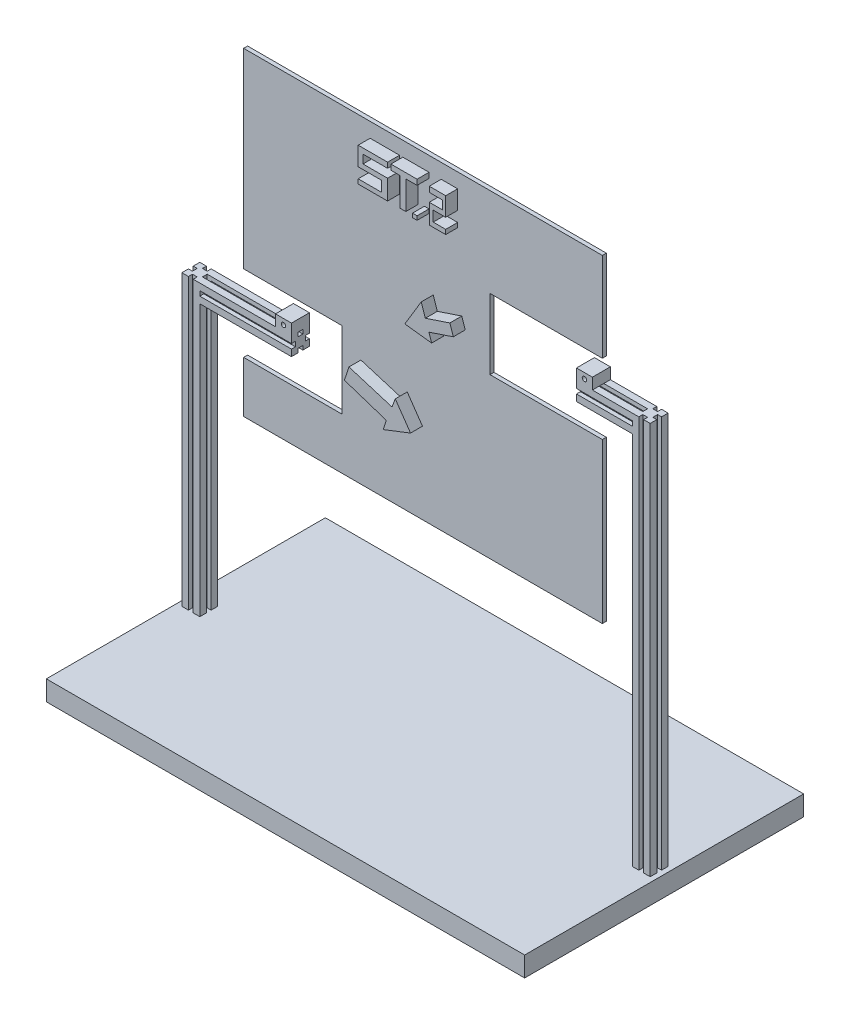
from build123d import *

# Parameters (mm, degrees)
SCHIZZO1_W                        = 1200
SCHIZZO1_H                        = 700
ESTRUSIONE_ESTRUSIONE1_DEPTH      = 50
ESTRUSIONE_ESTRUSIONE2_DEPTH      = 680
ESTRUSIONE_ESTRUSIONE2_DEPTH_BACK = 45
ESTRUSIONE_ESTRUSIONE2_START      = 45
ESTRUSIONE_ESTRUSIONE3_DEPTH      = 985
ESTRUSIONE_ESTRUSIONE4_DEPTH      = 230
SCHIZZO5_W                        = 40
SCHIZZO5_H                        = 45
ESTRUSIONE_ESTRUSIONE5_DEPTH      = 28
SCHIZZO6_R                        = 5.5
TAGLIO_ESTRUSIONE1_DEPTH          = 45
ESTRUSIONE_ESTRUSIONE6_DEPTH      = 140
SCHIZZO8_W                        = 40
SCHIZZO8_H                        = 45
ESTRUSIONE_ESTRUSIONE7_DEPTH      = 28
SCHIZZO9_R                        = 5.5
TAGLIO_ESTRUSIONE2_DEPTH          = 45
ESTRUSIONE_ESTRUSIONE8_DEPTH      = 10
SCHIZZO11_W                       = 11.455508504
SCHIZZO11_H                       = 9.928107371
ESTRUSIONE_ESTRUSIONE9_DEPTH      = 30
ESTRUSIONE_ESTRUSIONE10_DEPTH     = 30
ESTRUSIONE_ESTRUSIONE11_DEPTH     = 30


with BuildPart() as part:
    # Schizzo1 → Estrusione-Estrusione1 (new body)
    with BuildSketch(Plane(origin=(0, 0, 0), x_dir=(1, 0, 0), z_dir=(0, 1, 0))):
        Rectangle(SCHIZZO1_W, SCHIZZO1_H)
    extrude(amount=ESTRUSIONE_ESTRUSIONE1_DEPTH)


with BuildPart() as body_2:
    # Schizzo2 → Estrusione-Estrusione2 (new, two sides: drawn at the far end of the back side and taken through both)
    with BuildSketch(Plane(origin=(0, 50, 0), x_dir=(1, 0, 0), z_dir=(0, 1, 0)).offset(ESTRUSIONE_ESTRUSIONE2_START - ESTRUSIONE_ESTRUSIONE2_DEPTH_BACK)):
        Polygon((-571, 22.5), (-587.5, 22.5), (-587.5, 6), (-577.5, 6), (-577.5, -6), (-587.5, -6), (-587.5, -22.5), (-571, -22.5), (-571, -12.5), (-559, -12.5), (-559, -22.5), (-542.5, -22.5), (-542.5, -6), (-552.5, -6), (-552.5, 6), (-542.5, 6), (-542.5, 22.5), (-559, 22.5), (-559, 12.5), (-571, 12.5), align=None)
    extrude(amount=ESTRUSIONE_ESTRUSIONE2_DEPTH + ESTRUSIONE_ESTRUSIONE2_DEPTH_BACK)

    # Schizzo4 → Estrusione-Estrusione4 (add)
    with BuildSketch(Plane(origin=(-542.5, 0, 0), x_dir=(0, 0, -1), z_dir=(1, 0, 0))):
        Polygon((22.5, 775), (6, 775), (6, 765), (-6, 765), (-6, 740), (6, 740), (6, 730), (22.5, 730), (22.5, 746.5), (12.5, 746.5), (12.5, 758.5), (22.5, 758.5), align=None)
        Polygon((-6, 775), (-22.5, 775), (-22.5, 758.5), (-12.5, 758.5), (-12.5, 746.5), (-22.5, 746.5), (-22.5, 730), (-6, 730), (-6, 740), (-6, 765), align=None)
    extrude(amount=ESTRUSIONE_ESTRUSIONE4_DEPTH)

    # Schizzo5 → Estrusione-Estrusione5 (add)
    with BuildSketch(Plane(origin=(0, 775, 0), x_dir=(1, 0, 0), z_dir=(0, 1, 0))):
        with Locations((-332.5, 0)):
            Rectangle(SCHIZZO5_W, SCHIZZO5_H)
    extrude(amount=ESTRUSIONE_ESTRUSIONE5_DEPTH)

    # Schizzo6 → Taglio-Estrusione1 (cut)
    with BuildSketch(Plane.XY.offset(22.5)):
        with Locations((-332.5, 789)):
            Circle(SCHIZZO6_R)
    extrude(amount=-TAGLIO_ESTRUSIONE1_DEPTH, mode=Mode.SUBTRACT)


with BuildPart() as body_3:
    # Schizzo3 → Estrusione-Estrusione3 (new body)
    with BuildSketch(Plane(origin=(0, 50, 0), x_dir=(1, 0, 0), z_dir=(0, 1, 0))):
        Polygon((559, 22.5), (542.5, 22.5), (542.5, 6), (552.5, 6), (552.5, -6), (542.5, -6), (542.5, -22.5), (559, -22.5), (559, -12.5), (571, -12.5), (571, -22.5), (587.5, -22.5), (587.5, -6), (577.5, -6), (577.5, 6), (587.5, 6), (587.5, 22.5), (571, 22.5), (571, 12.5), (559, 12.5), align=None)
    extrude(amount=ESTRUSIONE_ESTRUSIONE3_DEPTH)

    # Schizzo7 → Estrusione-Estrusione6 (add)
    with BuildSketch(Plane.ZY.offset(-542.5)):
        Polygon((22.5, 1035), (6, 1035), (6, 1025), (6, 1000), (6, 990), (22.5, 990), (22.5, 1006.5), (12.5, 1006.5), (12.5, 1018.5), (22.5, 1018.5), align=None)
        Polygon((-6, 1035), (-22.5, 1035), (-22.5, 1018.5), (-12.5, 1018.5), (-12.5, 1006.5), (-22.5, 1006.5), (-22.5, 990), (-6, 990), (-6, 1000), (6, 1000), (6, 1025), (-6, 1025), align=None)
    extrude(amount=ESTRUSIONE_ESTRUSIONE6_DEPTH)

    # Schizzo8 → Estrusione-Estrusione7 (add)
    with BuildSketch(Plane(origin=(0, 1035, 0), x_dir=(1, 0, 0), z_dir=(0, 1, 0))):
        with Locations((422.5, 0)):
            Rectangle(SCHIZZO8_W, SCHIZZO8_H)
    extrude(amount=ESTRUSIONE_ESTRUSIONE7_DEPTH)

    # Schizzo9 → Taglio-Estrusione2 (cut)
    with BuildSketch(Plane.XY.offset(22.5)):
        with Locations((422.5, 1049)):
            Circle(SCHIZZO9_R)
    extrude(amount=-TAGLIO_ESTRUSIONE2_DEPTH, mode=Mode.SUBTRACT)


with BuildPart() as body_4:
    # Schizzo10 → Estrusione-Estrusione8 (new body)
    with BuildSketch(Plane.XY.offset(22.5)):
        Polygon((-422.552277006, 1350), (477.447722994, 1350), (477.447722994, 1126.471016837), (195.424355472, 1126.471016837), (195.424355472, 950), (477.447722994, 950), (477.447722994, 550), (-422.552277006, 550), (-422.552277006, 678.522000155), (-175.130328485, 678.522000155), (-175.130328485, 870.835190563), (-422.552277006, 870.835190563), align=None)
    extrude(amount=ESTRUSIONE_ESTRUSIONE8_DEPTH)

    # Schizzo11 → Estrusione-Estrusione9 (add)
    with BuildSketch(Plane.XY.offset(32.5)):
        Polygon((-105.14517176, 1313.223906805), (-31.39004955, 1313.223906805), (-31.39004955, 1299.813884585), (-93.076151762, 1299.813884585), (-93.076151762, 1278.357849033), (-31.39004955, 1278.357849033), (-31.39004955, 1228.740766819), (-105.14517176, 1228.740766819), (-105.14517176, 1240.139285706), (-46.141073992, 1240.139285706), (-46.141073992, 1266.288829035), (-105.14517176, 1266.288829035), align=None)
        Polygon((0, 1228.740766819), (14.35923213, 1228.740766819), (14.35923213, 1299.813884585), (42.616153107, 1299.813884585), (42.616153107, 1313.223906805), (-23.062095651, 1313.223906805), (-23.062095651, 1299.813884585), (0, 1299.813884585), align=None)
        Polygon((73.164175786, 1313.223906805), (73.164175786, 1299.813884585), (106.767000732, 1299.813884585), (106.767000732, 1278.357849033), (73.164175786, 1278.357849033), (73.164175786, 1228.740766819), (114.404006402, 1228.740766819), (114.404006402, 1240.139285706), (83.092283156, 1240.139285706), (83.092283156, 1266.288829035), (114.404006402, 1266.288829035), (114.404006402, 1313.223906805), align=None)
        with Locations((36.888398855, 1228.754969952)):
            Rectangle(SCHIZZO11_W, SCHIZZO11_H)
    extrude(amount=ESTRUSIONE_ESTRUSIONE9_DEPTH)

    # Schizzo12 → Estrusione-Estrusione10 (add)
    with BuildSketch(Plane.XY.offset(32.5)):
        Polygon((63.410989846, 1021.471140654), (124.819450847, 1041.940627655), (133.434668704, 1016.094974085), (72.16325436, 995.671169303), (79.059945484, 975.341066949), (11.935083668, 983.399179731), (53.101941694, 1051.860206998), align=None)
    extrude(amount=ESTRUSIONE_ESTRUSIONE10_DEPTH)

    # Schizzo13 → Estrusione-Estrusione11 (add)
    with BuildSketch(Plane.XY.offset(32.5)):
        Polygon((-139.702748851, 785.24301288), (-34.478087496, 750.669195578), (-42.134577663, 726.76949108), (26.178954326, 753.335864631), (-12.084479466, 808.619073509), (-20.365111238, 786.852841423), (-128.342780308, 819.816830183), align=None)
    extrude(amount=ESTRUSIONE_ESTRUSIONE11_DEPTH)


solid = Compound([part.part, body_2.part, body_3.part, body_4.part])
